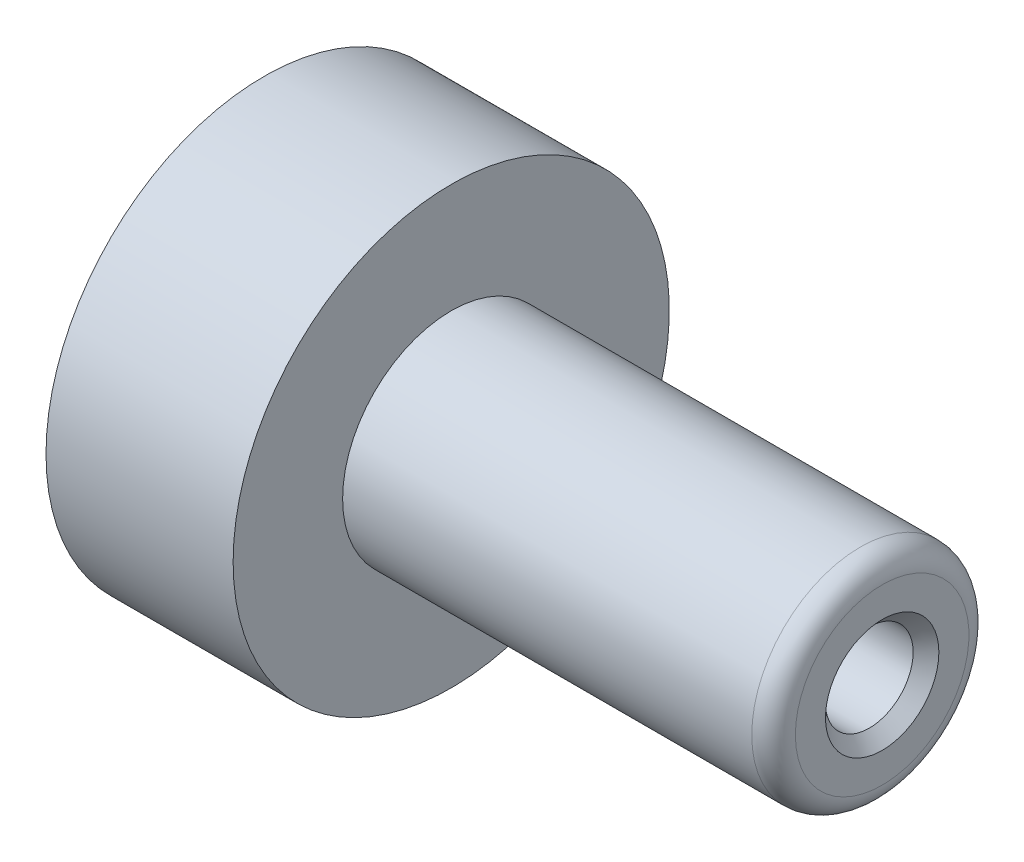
ISO-10303-21;
HEADER;
FILE_DESCRIPTION(('STEP AP214'),'2;1');
FILE_NAME('part.step','',(''),(''),'','','');
FILE_SCHEMA(('AUTOMOTIVE_DESIGN { 1 0 10303 214 1 1 1 1 }'));
ENDSEC;
DATA;
#1=APPLICATION_CONTEXT('core data for automotive mechanical design processes');
#2=APPLICATION_PROTOCOL_DEFINITION('international standard','automotive_design',2000,#1);
#3=PRODUCT_CONTEXT('',#1,'mechanical');
#4=PRODUCT('Part','Part','',(#3));
#5=PRODUCT_RELATED_PRODUCT_CATEGORY('part','',(#4));
#6=PRODUCT_DEFINITION_FORMATION('','',#4);
#7=PRODUCT_DEFINITION_CONTEXT('part definition',#1,'design');
#8=PRODUCT_DEFINITION('design','',#6,#7);
#9=PRODUCT_DEFINITION_SHAPE('','',#8);
#10=(LENGTH_UNIT() NAMED_UNIT(*) SI_UNIT(.MILLI.,.METRE.));
#11=(NAMED_UNIT(*) PLANE_ANGLE_UNIT() SI_UNIT($,.RADIAN.));
#12=(NAMED_UNIT(*) SI_UNIT($,.STERADIAN.) SOLID_ANGLE_UNIT());
#13=UNCERTAINTY_MEASURE_WITH_UNIT(LENGTH_MEASURE(1.E-05),#10,'distance_accuracy_value','');
#14=(GEOMETRIC_REPRESENTATION_CONTEXT(3) GLOBAL_UNCERTAINTY_ASSIGNED_CONTEXT((#13)) GLOBAL_UNIT_ASSIGNED_CONTEXT((#10,
#11,#12)) REPRESENTATION_CONTEXT('',''));
#15=CARTESIAN_POINT('',(0.,0.,0.));
#16=DIRECTION('',(0.,0.,1.));
#17=DIRECTION('',(1.,0.,0.));
#18=AXIS2_PLACEMENT_3D('',#15,#16,#17);
#19=CARTESIAN_POINT('',(0.,0.,0.));
#20=DIRECTION('',(-1.,0.,0.));
#21=DIRECTION('',(0.,0.,1.));
#22=AXIS2_PLACEMENT_3D('',#19,#20,#21);
#23=CYLINDRICAL_SURFACE('',#22,3.9751);
#24=CARTESIAN_POINT('',(21.8948,0.,0.));
#25=DIRECTION('',(-1.,0.,0.));
#26=DIRECTION('',(0.,0.,1.));
#27=AXIS2_PLACEMENT_3D('',#24,#25,#26);
#28=CIRCLE('',#27,3.9751);
#29=CARTESIAN_POINT('',(21.8948,0.,3.9751));
#30=VERTEX_POINT('',#29);
#31=EDGE_CURVE('E44',#30,#30,#28,.T.);
#32=ORIENTED_EDGE('',*,*,#31,.F.);
#33=EDGE_LOOP('',(#32));
#34=FACE_BOUND('',#33,.T.);
#35=CARTESIAN_POINT('',(0.,0.,0.));
#36=DIRECTION('',(-1.,0.,0.));
#37=DIRECTION('',(0.,0.,1.));
#38=AXIS2_PLACEMENT_3D('',#35,#36,#37);
#39=CIRCLE('',#38,3.9751);
#40=CARTESIAN_POINT('',(0.,0.,3.9751));
#41=VERTEX_POINT('',#40);
#42=EDGE_CURVE('E65',#41,#41,#39,.T.);
#43=ORIENTED_EDGE('',*,*,#42,.T.);
#44=EDGE_LOOP('',(#43));
#45=FACE_BOUND('',#44,.T.);
#46=ADVANCED_FACE('F33',(#34,#45),#23,.F.);
#47=CARTESIAN_POINT('',(21.8948,3.9751,0.));
#48=DIRECTION('',(1.,0.,0.));
#49=DIRECTION('',(0.,0.,-1.));
#50=AXIS2_PLACEMENT_3D('',#47,#48,#49);
#51=PLANE('',#50);
#52=CARTESIAN_POINT('',(21.8948,0.,0.));
#53=DIRECTION('',(1.,0.,0.));
#54=DIRECTION('',(0.,0.,-1.));
#55=AXIS2_PLACEMENT_3D('',#52,#53,#54);
#56=CIRCLE('',#55,2.5527);
#57=CARTESIAN_POINT('',(21.8948,0.,-2.5527));
#58=VERTEX_POINT('',#57);
#59=EDGE_CURVE('E78',#58,#58,#56,.T.);
#60=ORIENTED_EDGE('',*,*,#59,.T.);
#61=EDGE_LOOP('',(#60));
#62=FACE_BOUND('',#61,.T.);
#63=ORIENTED_EDGE('',*,*,#31,.T.);
#64=EDGE_LOOP('',(#63));
#65=FACE_BOUND('',#64,.T.);
#66=ADVANCED_FACE('F84',(#62,#65),#51,.F.);
#67=CARTESIAN_POINT('',(35.9918,5.0546,0.));
#68=DIRECTION('',(-1.,0.,0.));
#69=DIRECTION('',(0.,0.,1.));
#70=AXIS2_PLACEMENT_3D('',#67,#68,#69);
#71=PLANE('',#70);
#72=CARTESIAN_POINT('',(35.9918,0.,0.));
#73=DIRECTION('',(-1.,0.,0.));
#74=DIRECTION('',(0.,0.,1.));
#75=AXIS2_PLACEMENT_3D('',#72,#73,#74);
#76=CIRCLE('',#75,3.302);
#77=CARTESIAN_POINT('',(35.9918,0.,-3.302));
#78=VERTEX_POINT('',#77);
#79=EDGE_CURVE('E10',#78,#78,#76,.T.);
#80=ORIENTED_EDGE('',*,*,#79,.T.);
#81=EDGE_LOOP('',(#80));
#82=FACE_BOUND('',#81,.T.);
#83=CARTESIAN_POINT('',(35.9918,0.,0.));
#84=DIRECTION('',(-1.,0.,0.));
#85=DIRECTION('',(0.,0.,1.));
#86=AXIS2_PLACEMENT_3D('',#83,#84,#85);
#87=CIRCLE('',#86,5.0546);
#88=CARTESIAN_POINT('',(35.9918,0.,5.0546));
#89=VERTEX_POINT('',#88);
#90=EDGE_CURVE('E48',#89,#89,#87,.T.);
#91=ORIENTED_EDGE('',*,*,#90,.F.);
#92=EDGE_LOOP('',(#91));
#93=FACE_BOUND('',#92,.T.);
#94=ADVANCED_FACE('F104',(#82,#93),#71,.F.);
#95=CARTESIAN_POINT('',(34.7218,0.,0.));
#96=DIRECTION('',(-1.,0.,0.));
#97=DIRECTION('',(0.,0.,1.));
#98=AXIS2_PLACEMENT_3D('',#95,#96,#97);
#99=TOROIDAL_SURFACE('',#98,5.0546,1.27);
#100=CARTESIAN_POINT('',(34.7218,0.,0.));
#101=DIRECTION('',(-1.,0.,0.));
#102=DIRECTION('',(0.,0.,1.));
#103=AXIS2_PLACEMENT_3D('',#100,#101,#102);
#104=CIRCLE('',#103,6.3246);
#105=CARTESIAN_POINT('',(34.7218,0.,6.3246));
#106=VERTEX_POINT('',#105);
#107=EDGE_CURVE('E53',#106,#106,#104,.T.);
#108=ORIENTED_EDGE('',*,*,#107,.F.);
#109=EDGE_LOOP('',(#108));
#110=FACE_BOUND('',#109,.T.);
#111=ORIENTED_EDGE('',*,*,#90,.T.);
#112=EDGE_LOOP('',(#111));
#113=FACE_BOUND('',#112,.T.);
#114=ADVANCED_FACE('F111',(#110,#113),#99,.T.);
#115=CARTESIAN_POINT('',(0.,0.,0.));
#116=DIRECTION('',(-1.,0.,0.));
#117=DIRECTION('',(0.,0.,1.));
#118=AXIS2_PLACEMENT_3D('',#115,#116,#117);
#119=CYLINDRICAL_SURFACE('',#118,6.3246);
#120=CARTESIAN_POINT('',(10.8966,0.,0.));
#121=DIRECTION('',(-1.,0.,0.));
#122=DIRECTION('',(0.,0.,1.));
#123=AXIS2_PLACEMENT_3D('',#120,#121,#122);
#124=CIRCLE('',#123,6.3246);
#125=CARTESIAN_POINT('',(10.8966,0.,6.3246));
#126=VERTEX_POINT('',#125);
#127=EDGE_CURVE('E56',#126,#126,#124,.T.);
#128=ORIENTED_EDGE('',*,*,#127,.F.);
#129=EDGE_LOOP('',(#128));
#130=FACE_BOUND('',#129,.T.);
#131=ORIENTED_EDGE('',*,*,#107,.T.);
#132=EDGE_LOOP('',(#131));
#133=FACE_BOUND('',#132,.T.);
#134=ADVANCED_FACE('F114',(#130,#133),#119,.T.);
#135=CARTESIAN_POINT('',(10.8966,12.7,0.));
#136=DIRECTION('',(-1.,0.,0.));
#137=DIRECTION('',(0.,0.,1.));
#138=AXIS2_PLACEMENT_3D('',#135,#136,#137);
#139=PLANE('',#138);
#140=CARTESIAN_POINT('',(10.8966,0.,0.));
#141=DIRECTION('',(-1.,0.,0.));
#142=DIRECTION('',(0.,0.,1.));
#143=AXIS2_PLACEMENT_3D('',#140,#141,#142);
#144=CIRCLE('',#143,12.7);
#145=CARTESIAN_POINT('',(10.8966,0.,12.7));
#146=VERTEX_POINT('',#145);
#147=EDGE_CURVE('E59',#146,#146,#144,.T.);
#148=ORIENTED_EDGE('',*,*,#147,.F.);
#149=EDGE_LOOP('',(#148));
#150=FACE_BOUND('',#149,.T.);
#151=ORIENTED_EDGE('',*,*,#127,.T.);
#152=EDGE_LOOP('',(#151));
#153=FACE_BOUND('',#152,.T.);
#154=ADVANCED_FACE('F118',(#150,#153),#139,.F.);
#155=CARTESIAN_POINT('',(0.,0.,0.));
#156=DIRECTION('',(-1.,0.,0.));
#157=DIRECTION('',(0.,0.,1.));
#158=AXIS2_PLACEMENT_3D('',#155,#156,#157);
#159=CYLINDRICAL_SURFACE('',#158,12.7);
#160=CARTESIAN_POINT('',(0.,0.,0.));
#161=DIRECTION('',(-1.,0.,0.));
#162=DIRECTION('',(0.,0.,1.));
#163=AXIS2_PLACEMENT_3D('',#160,#161,#162);
#164=CIRCLE('',#163,12.7);
#165=CARTESIAN_POINT('',(0.,0.,12.7));
#166=VERTEX_POINT('',#165);
#167=EDGE_CURVE('E62',#166,#166,#164,.T.);
#168=ORIENTED_EDGE('',*,*,#167,.F.);
#169=EDGE_LOOP('',(#168));
#170=FACE_BOUND('',#169,.T.);
#171=ORIENTED_EDGE('',*,*,#147,.T.);
#172=EDGE_LOOP('',(#171));
#173=FACE_BOUND('',#172,.T.);
#174=ADVANCED_FACE('F122',(#170,#173),#159,.T.);
#175=CARTESIAN_POINT('',(0.,3.9751,0.));
#176=DIRECTION('',(1.,0.,0.));
#177=DIRECTION('',(0.,0.,-1.));
#178=AXIS2_PLACEMENT_3D('',#175,#176,#177);
#179=PLANE('',#178);
#180=CARTESIAN_POINT('',(0.,0.,7.1374));
#181=DIRECTION('',(-1.,0.,0.));
#182=DIRECTION('',(0.,0.,-1.));
#183=AXIS2_PLACEMENT_3D('',#180,#181,#182);
#184=CIRCLE('',#183,1.6129);
#185=CARTESIAN_POINT('',(0.,0.,5.5245));
#186=VERTEX_POINT('',#185);
#187=EDGE_CURVE('E75',#186,#186,#184,.T.);
#188=ORIENTED_EDGE('',*,*,#187,.F.);
#189=EDGE_LOOP('',(#188));
#190=FACE_BOUND('',#189,.T.);
#191=CARTESIAN_POINT('',(0.,0.,-7.1374));
#192=DIRECTION('',(-1.,0.,0.));
#193=DIRECTION('',(0.,0.,1.));
#194=AXIS2_PLACEMENT_3D('',#191,#192,#193);
#195=CIRCLE('',#194,1.6129);
#196=CARTESIAN_POINT('',(0.,0.,-5.5245));
#197=VERTEX_POINT('',#196);
#198=EDGE_CURVE('E69',#197,#197,#195,.T.);
#199=ORIENTED_EDGE('',*,*,#198,.F.);
#200=EDGE_LOOP('',(#199));
#201=FACE_BOUND('',#200,.T.);
#202=ORIENTED_EDGE('',*,*,#42,.F.);
#203=EDGE_LOOP('',(#202));
#204=FACE_BOUND('',#203,.T.);
#205=ORIENTED_EDGE('',*,*,#167,.T.);
#206=EDGE_LOOP('',(#205));
#207=FACE_BOUND('',#206,.T.);
#208=ADVANCED_FACE('F126',(#190,#201,#204,#207),#179,.F.);
#209=CARTESIAN_POINT('',(6.35,0.,-7.1374));
#210=DIRECTION('',(-1.,0.,0.));
#211=DIRECTION('',(0.,0.,1.));
#212=AXIS2_PLACEMENT_3D('',#209,#210,#211);
#213=CYLINDRICAL_SURFACE('',#212,1.6129);
#214=CARTESIAN_POINT('',(6.35,0.,-7.1374));
#215=DIRECTION('',(-1.,0.,0.));
#216=DIRECTION('',(0.,0.,1.));
#217=AXIS2_PLACEMENT_3D('',#214,#215,#216);
#218=CIRCLE('',#217,1.6129);
#219=CARTESIAN_POINT('',(6.35,0.,-5.5245));
#220=VERTEX_POINT('',#219);
#221=EDGE_CURVE('E68',#220,#220,#218,.T.);
#222=ORIENTED_EDGE('',*,*,#221,.F.);
#223=EDGE_LOOP('',(#222));
#224=FACE_BOUND('',#223,.T.);
#225=ORIENTED_EDGE('',*,*,#198,.T.);
#226=EDGE_LOOP('',(#225));
#227=FACE_BOUND('',#226,.T.);
#228=ADVANCED_FACE('F130',(#224,#227),#213,.F.);
#229=CARTESIAN_POINT('',(6.35,0.,-7.1374));
#230=DIRECTION('',(-1.,0.,0.));
#231=DIRECTION('',(0.,0.,1.));
#232=AXIS2_PLACEMENT_3D('',#229,#230,#231);
#233=PLANE('',#232);
#234=ORIENTED_EDGE('',*,*,#221,.T.);
#235=EDGE_LOOP('',(#234));
#236=FACE_BOUND('',#235,.T.);
#237=ADVANCED_FACE('F134',(#236),#233,.T.);
#238=CARTESIAN_POINT('',(6.35,0.,7.1374));
#239=DIRECTION('',(-1.,0.,0.));
#240=DIRECTION('',(0.,0.,1.));
#241=AXIS2_PLACEMENT_3D('',#238,#239,#240);
#242=CYLINDRICAL_SURFACE('',#241,1.6129);
#243=CARTESIAN_POINT('',(6.35,0.,7.1374));
#244=DIRECTION('',(-1.,0.,0.));
#245=DIRECTION('',(0.,0.,-1.));
#246=AXIS2_PLACEMENT_3D('',#243,#244,#245);
#247=CIRCLE('',#246,1.6129);
#248=CARTESIAN_POINT('',(6.35,0.,5.5245));
#249=VERTEX_POINT('',#248);
#250=EDGE_CURVE('E72',#249,#249,#247,.T.);
#251=ORIENTED_EDGE('',*,*,#250,.F.);
#252=EDGE_LOOP('',(#251));
#253=FACE_BOUND('',#252,.T.);
#254=ORIENTED_EDGE('',*,*,#187,.T.);
#255=EDGE_LOOP('',(#254));
#256=FACE_BOUND('',#255,.T.);
#257=ADVANCED_FACE('F96',(#253,#256),#242,.F.);
#258=CARTESIAN_POINT('',(6.35,0.,7.1374));
#259=DIRECTION('',(1.,0.,0.));
#260=DIRECTION('',(0.,0.,-1.));
#261=AXIS2_PLACEMENT_3D('',#258,#259,#260);
#262=PLANE('',#261);
#263=ORIENTED_EDGE('',*,*,#250,.T.);
#264=EDGE_LOOP('',(#263));
#265=FACE_BOUND('',#264,.T.);
#266=ADVANCED_FACE('F89',(#265),#262,.F.);
#267=CARTESIAN_POINT('',(0.,0.,0.));
#268=DIRECTION('',(1.,0.,0.));
#269=DIRECTION('',(0.,0.,-1.));
#270=AXIS2_PLACEMENT_3D('',#267,#268,#269);
#271=CYLINDRICAL_SURFACE('',#270,2.5527);
#272=CARTESIAN_POINT('',(35.2425,0.,0.));
#273=DIRECTION('',(-1.,0.,0.));
#274=DIRECTION('',(0.,0.,1.));
#275=AXIS2_PLACEMENT_3D('',#272,#273,#274);
#276=CIRCLE('',#275,2.5527);
#277=CARTESIAN_POINT('',(35.2425,0.,-2.5527));
#278=VERTEX_POINT('',#277);
#279=EDGE_CURVE('E40',#278,#278,#276,.F.);
#280=ORIENTED_EDGE('',*,*,#279,.T.);
#281=EDGE_LOOP('',(#280));
#282=FACE_BOUND('',#281,.T.);
#283=ORIENTED_EDGE('',*,*,#59,.F.);
#284=EDGE_LOOP('',(#283));
#285=FACE_BOUND('',#284,.T.);
#286=ADVANCED_FACE('F87',(#282,#285),#271,.F.);
#287=CARTESIAN_POINT('',(35.2425,0.,0.));
#288=DIRECTION('',(1.,0.,0.));
#289=DIRECTION('',(0.,0.,-1.));
#290=AXIS2_PLACEMENT_3D('',#287,#288,#289);
#291=CONICAL_SURFACE('',#290,2.5527,0.785398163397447);
#292=CARTESIAN_POINT('',(35.9918,0.,-3.302));
#293=CARTESIAN_POINT('',(35.9839947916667,0.,-3.29419479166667));
#294=CARTESIAN_POINT('',(35.9761895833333,0.,-3.28638958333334));
#295=CARTESIAN_POINT('',(35.9605791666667,0.,-3.27077916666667));
#296=CARTESIAN_POINT('',(35.9527739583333,0.,-3.26297395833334));
#297=CARTESIAN_POINT('',(35.9371635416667,0.,-3.24736354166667));
#298=CARTESIAN_POINT('',(35.9293583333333,0.,-3.23955833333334));
#299=CARTESIAN_POINT('',(35.9137479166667,0.,-3.22394791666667));
#300=CARTESIAN_POINT('',(35.9059427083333,0.,-3.21614270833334));
#301=CARTESIAN_POINT('',(35.8903322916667,0.,-3.20053229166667));
#302=CARTESIAN_POINT('',(35.8825270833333,0.,-3.19272708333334));
#303=CARTESIAN_POINT('',(35.8669166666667,0.,-3.17711666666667));
#304=CARTESIAN_POINT('',(35.8591114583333,0.,-3.16931145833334));
#305=CARTESIAN_POINT('',(35.8435010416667,0.,-3.15370104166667));
#306=CARTESIAN_POINT('',(35.8356958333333,0.,-3.14589583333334));
#307=CARTESIAN_POINT('',(35.8200854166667,0.,-3.13028541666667));
#308=CARTESIAN_POINT('',(35.8122802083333,0.,-3.12248020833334));
#309=CARTESIAN_POINT('',(35.7966697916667,0.,-3.10686979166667));
#310=CARTESIAN_POINT('',(35.7888645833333,0.,-3.09906458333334));
#311=CARTESIAN_POINT('',(35.7732541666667,0.,-3.08345416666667));
#312=CARTESIAN_POINT('',(35.7654489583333,0.,-3.07564895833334));
#313=CARTESIAN_POINT('',(35.7498385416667,0.,-3.06003854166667));
#314=CARTESIAN_POINT('',(35.7420333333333,0.,-3.05223333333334));
#315=CARTESIAN_POINT('',(35.7264229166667,0.,-3.03662291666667));
#316=CARTESIAN_POINT('',(35.7186177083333,0.,-3.02881770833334));
#317=CARTESIAN_POINT('',(35.7030072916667,0.,-3.01320729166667));
#318=CARTESIAN_POINT('',(35.6952020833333,0.,-3.00540208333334));
#319=CARTESIAN_POINT('',(35.6795916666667,0.,-2.98979166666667));
#320=CARTESIAN_POINT('',(35.6717864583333,0.,-2.98198645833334));
#321=CARTESIAN_POINT('',(35.6561760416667,0.,-2.96637604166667));
#322=CARTESIAN_POINT('',(35.6483708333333,0.,-2.95857083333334));
#323=CARTESIAN_POINT('',(35.6327604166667,0.,-2.94296041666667));
#324=CARTESIAN_POINT('',(35.6249552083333,0.,-2.93515520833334));
#325=CARTESIAN_POINT('',(35.6093447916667,0.,-2.91954479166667));
#326=CARTESIAN_POINT('',(35.6015395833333,0.,-2.91173958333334));
#327=CARTESIAN_POINT('',(35.5859291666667,0.,-2.89612916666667));
#328=CARTESIAN_POINT('',(35.5781239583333,0.,-2.88832395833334));
#329=CARTESIAN_POINT('',(35.5625135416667,0.,-2.87271354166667));
#330=CARTESIAN_POINT('',(35.5547083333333,0.,-2.86490833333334));
#331=CARTESIAN_POINT('',(35.5390979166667,0.,-2.84929791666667));
#332=CARTESIAN_POINT('',(35.5312927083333,0.,-2.84149270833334));
#333=CARTESIAN_POINT('',(35.5156822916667,0.,-2.82588229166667));
#334=CARTESIAN_POINT('',(35.5078770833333,0.,-2.81807708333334));
#335=CARTESIAN_POINT('',(35.4922666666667,0.,-2.80246666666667));
#336=CARTESIAN_POINT('',(35.4844614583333,0.,-2.79466145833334));
#337=CARTESIAN_POINT('',(35.4688510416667,0.,-2.77905104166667));
#338=CARTESIAN_POINT('',(35.4610458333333,0.,-2.77124583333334));
#339=CARTESIAN_POINT('',(35.4454354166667,0.,-2.75563541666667));
#340=CARTESIAN_POINT('',(35.4376302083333,0.,-2.74783020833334));
#341=CARTESIAN_POINT('',(35.4220197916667,0.,-2.73221979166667));
#342=CARTESIAN_POINT('',(35.4142145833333,0.,-2.72441458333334));
#343=CARTESIAN_POINT('',(35.3986041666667,0.,-2.70880416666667));
#344=CARTESIAN_POINT('',(35.3907989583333,0.,-2.70099895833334));
#345=CARTESIAN_POINT('',(35.3751885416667,0.,-2.68538854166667));
#346=CARTESIAN_POINT('',(35.3673833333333,0.,-2.67758333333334));
#347=CARTESIAN_POINT('',(35.3517729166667,0.,-2.66197291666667));
#348=CARTESIAN_POINT('',(35.3439677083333,0.,-2.65416770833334));
#349=CARTESIAN_POINT('',(35.3283572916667,0.,-2.63855729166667));
#350=CARTESIAN_POINT('',(35.3205520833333,0.,-2.63075208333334));
#351=CARTESIAN_POINT('',(35.3049416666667,0.,-2.61514166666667));
#352=CARTESIAN_POINT('',(35.2971364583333,0.,-2.60733645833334));
#353=CARTESIAN_POINT('',(35.2815260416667,0.,-2.59172604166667));
#354=CARTESIAN_POINT('',(35.2737208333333,0.,-2.58392083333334));
#355=CARTESIAN_POINT('',(35.2581104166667,0.,-2.56831041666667));
#356=CARTESIAN_POINT('',(35.2503052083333,0.,-2.56050520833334));
#357=CARTESIAN_POINT('',(35.2425,0.,-2.5527));
#358=B_SPLINE_CURVE_WITH_KNOTS('',3,(#292,#293,#294,#295,#296,#297,#298,#299,#300,#301,#302,
#303,#304,#305,#306,#307,#308,#309,#310,#311,#312,#313,#314,#315,#316,#317,#318,#319,#320,#321,
#322,#323,#324,#325,#326,#327,#328,#329,#330,#331,#332,#333,#334,#335,#336,#337,#338,#339,#340,
#341,#342,#343,#344,#345,#346,#347,#348,#349,#350,#351,#352,#353,#354,#355,#356,#357),
.UNSPECIFIED.,.F.,.F.,(4,2,2,2,2,2,2,2,2,2,2,2,2,2,2,2,2,2,2,2,2,2,2,2,2,2,2,2,2,2,2,2,4),(0.,
0.0331146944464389,0.0662293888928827,0.0993440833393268,0.132458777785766,0.165573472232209,
0.198688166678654,0.231802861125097,0.264917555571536,0.29803225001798,0.331146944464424,
0.364261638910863,0.397376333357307,0.430491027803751,0.463605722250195,0.496720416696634,
0.529835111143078,0.562949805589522,0.596064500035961,0.629179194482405,0.662293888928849,
0.695408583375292,0.728523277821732,0.761637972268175,0.794752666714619,0.827867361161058,
0.860982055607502,0.894096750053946,0.92721144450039,0.960326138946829,0.993440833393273,
1.02655552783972,1.05967022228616),.UNSPECIFIED.);
#359=EDGE_CURVE('BSEAM35',#78,#278,#358,.T.);
#360=ORIENTED_EDGE('',*,*,#79,.F.);
#361=ORIENTED_EDGE('',*,*,#279,.F.);
#362=ORIENTED_EDGE('',*,*,#359,.T.);
#363=ORIENTED_EDGE('',*,*,#359,.F.);
#364=EDGE_LOOP('',(#360,#362,#361,#363));
#365=FACE_BOUND('',#364,.T.);
#366=ADVANCED_FACE('F35',(#365),#291,.F.);
#367=CLOSED_SHELL('',(#46,#66,#94,#114,#134,#154,#174,#208,#228,#237,#257,#266,#286,#366));
#368=MANIFOLD_SOLID_BREP('B2',#367);
#369=ADVANCED_BREP_SHAPE_REPRESENTATION('',(#18,#368),#14);
#370=SHAPE_DEFINITION_REPRESENTATION(#9,#369);
ENDSEC;
END-ISO-10303-21;
